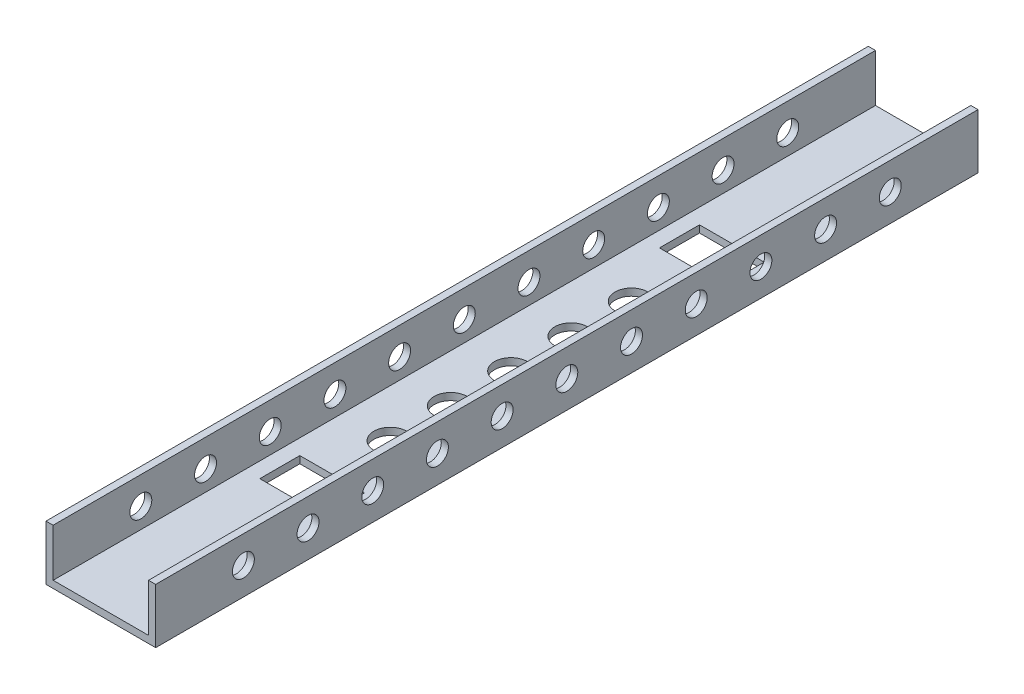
from build123d import *

# Parameters (mm, degrees)
BOSS_EXTRUDE1_DEPTH = 381
SKETCH3_R           = 5.08
CUT_EXTRUDE1_DEPTH  = 71.12
SKETCH4_R           = 5.08
CUT_EXTRUDE2_DEPTH  = 88.9
SKETCH5_W           = 29.972
SKETCH5_H           = 18.542
CUT_EXTRUDE3_DEPTH  = 88.9
SKETCH6_W           = 29.972
SKETCH6_H           = 18.542
CUT_EXTRUDE4_DEPTH  = 88.9
SKETCH8_R           = 7.62
CUT_EXTRUDE6_DEPTH  = 24.638


with BuildPart() as part:
    # Sketch2 → Boss-Extrude1 (new body)
    with BuildSketch(Plane.XY):
        Polygon((-22.93081761, -18.810691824), (-22.93081761, 6.589308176), (-19.62881761, 6.589308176), (-19.62881761, -15.508691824), (24.56718239, -15.508691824), (24.56718239, 6.589308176), (27.86918239, 6.589308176), (27.86918239, -18.810691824), align=None)
    extrude(amount=BOSS_EXTRUDE1_DEPTH)

    # Sketch3 → Cut-Extrude1 (cut)
    with BuildSketch(Plane(origin=(27.86918239, 0, 0), x_dir=(0, 0, -1), z_dir=(1, 0, 0))):
        with Locations((-190.5, -6.110691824)):
            Circle(SKETCH3_R)
    extrude(amount=-CUT_EXTRUDE1_DEPTH, mode=Mode.SUBTRACT)

    # Sketch4 → Cut-Extrude2 (cut)
    with BuildSketch(Plane(origin=(27.86918239, 0, 0), x_dir=(0, 0, -1), z_dir=(1, 0, 0))):
        with Locations((-220.472, -6.110691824)):
            Circle(SKETCH4_R)
        with Locations((-250.444, -6.110691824)):
            Circle(SKETCH4_R)
        with Locations((-280.416, -6.110691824)):
            Circle(SKETCH4_R)
        with Locations((-310.388, -6.110691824)):
            Circle(SKETCH4_R)
        with Locations((-340.36, -6.110691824)):
            Circle(SKETCH4_R)
        with Locations((-160.528, -6.110691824)):
            Circle(SKETCH4_R)
        with Locations((-130.556, -6.110691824)):
            Circle(SKETCH4_R)
        with Locations((-100.584, -6.110691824)):
            Circle(SKETCH4_R)
        with Locations((-70.612, -6.110691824)):
            Circle(SKETCH4_R)
        with Locations((-40.64, -6.110691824)):
            Circle(SKETCH4_R)
    extrude(amount=-CUT_EXTRUDE2_DEPTH, mode=Mode.SUBTRACT)

    # Sketch5 → Cut-Extrude3 (cut)
    with BuildSketch(Plane(origin=(0, -15.508691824, 0), x_dir=(1, 0, 0), z_dir=(0, 1, 0))):
        with Locations((2.46918239, -97.917)):
            Rectangle(SKETCH5_W, SKETCH5_H)
    extrude(amount=-CUT_EXTRUDE3_DEPTH, mode=Mode.SUBTRACT)

    # Sketch6 → Cut-Extrude4 (cut)
    with BuildSketch(Plane(origin=(0, -15.508691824, 0), x_dir=(1, 0, 0), z_dir=(0, 1, 0))):
        with Locations((2.46918239, -283.083)):
            Rectangle(SKETCH6_W, SKETCH6_H)
    extrude(amount=-CUT_EXTRUDE4_DEPTH, mode=Mode.SUBTRACT)

    # Sketch8 → Cut-Extrude6 (cut)
    with BuildSketch(Plane(origin=(0, -15.508691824, 0), x_dir=(1, 0, 0), z_dir=(0, 1, 0))):
        with Locations(Location((2.46918239, -135.128, 0), (0, 0, 270))):
            Circle(SKETCH8_R)
        with Locations(Location((2.46918239, -163.068, 0), (0, 0, 270))):
            Circle(SKETCH8_R)
        with Locations(Location((2.46918239, -191.008, 0), (0, 0, 270))):
            Circle(SKETCH8_R)
        with Locations(Location((2.46918239, -218.948, 0), (0, 0, 270))):
            Circle(SKETCH8_R)
        with Locations(Location((2.46918239, -246.888, 0), (0, 0, 270))):
            Circle(SKETCH8_R)
    extrude(amount=-CUT_EXTRUDE6_DEPTH, mode=Mode.SUBTRACT)


solid = part.part
